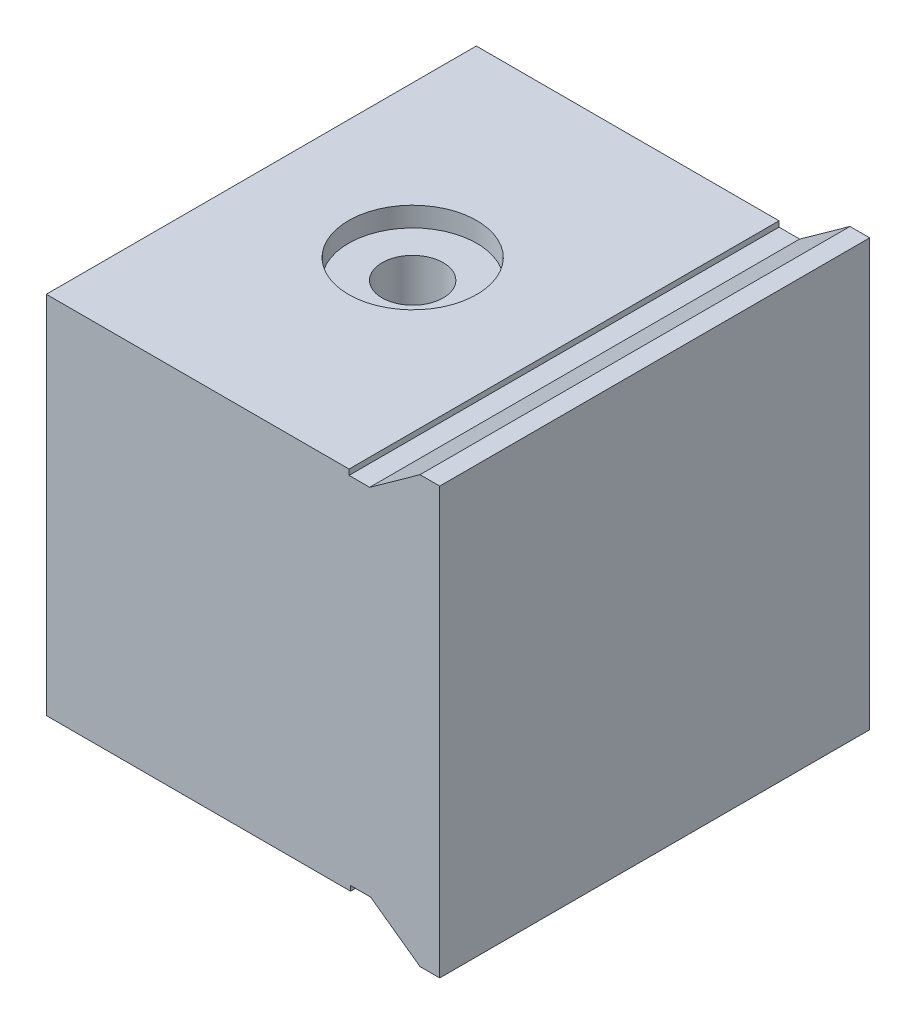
from build123d import *

# Parameters (mm, degrees)
SALIENTE_EXTRUIR1_DEPTH      = 21.8
SALIENTE_EXTRUIR1_DEPTH_BACK = 21.8
CROQUIS5_R                   = 3.1
CORTAR_EXTRUIR3_DEPTH        = 10
CROQUIS6_R                   = 6.5
CORTAR_EXTRUIR4_DEPTH        = 2
CROQUIS7_W                   = 21
CROQUIS7_H                   = 21
CORTAR_EXTRUIR5_DEPTH        = 28


with BuildPart() as part:
    # Croquis1 → Saliente-Extruir1 (new, two sides: drawn at the far end of the back side and taken through both)
    with BuildSketch(Plane.XY.offset(-SALIENTE_EXTRUIR1_DEPTH_BACK)):
        Polygon((-30.989332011, -16.758305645), (-5.135433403, -16.758305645), (-0.135433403, -16.758305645), (-0.137534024, -16.258306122), (-0.288534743, 19.683577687), (-0.290879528, 20.241694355), (-6.290879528, 20.241694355), (-30.989332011, 20.241694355), align=None)
        Polygon((-0.288534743, 19.683577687), (-0.137534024, -16.258306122), (1.902904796, -16.258306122), (6.902904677, -19.858306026), (8.902905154, -19.858306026), (8.902905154, 23.341694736), (6.902904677, 23.341694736), (1.801324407, 19.683577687), align=None)
    extrude(amount=SALIENTE_EXTRUIR1_DEPTH + SALIENTE_EXTRUIR1_DEPTH_BACK)

    # Croquis5 → Cortar-Extruir3 (cut)
    with BuildSketch(Plane(origin=(0, 20.241694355, 0), x_dir=(1, 0, 0), z_dir=(0, 1, 0))):
        with Locations(Location((-15.64010577, 0, 0), (0, 0, 270))):
            Circle(CROQUIS5_R)
    extrude(amount=-CORTAR_EXTRUIR3_DEPTH, mode=Mode.SUBTRACT)

    # Croquis6 → Cortar-Extruir4 (cut)
    with BuildSketch(Plane(origin=(0, 20.241694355, 0), x_dir=(1, 0, 0), z_dir=(0, 1, 0))):
        with Locations(Location((-15.64010577, 0, 0), (0, 0, 270))):
            Circle(CROQUIS6_R)
    extrude(amount=-CORTAR_EXTRUIR4_DEPTH, mode=Mode.SUBTRACT)

    # Croquis7 → Cortar-Extruir5 (cut)
    with BuildSketch(Plane.ZY.offset(30.989332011)):
        with Locations((0, 1.741694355)):
            Rectangle(CROQUIS7_W, CROQUIS7_H)
    extrude(amount=-CORTAR_EXTRUIR5_DEPTH, mode=Mode.SUBTRACT)


solid = part.part
